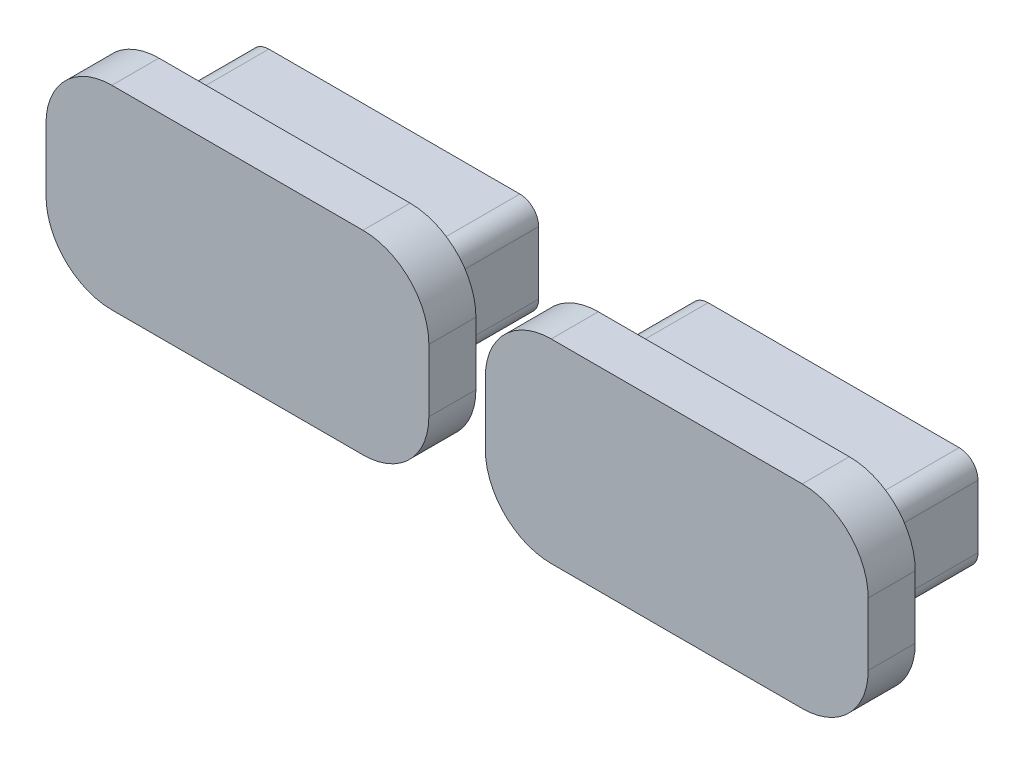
from build123d import *

# Parameters (mm, degrees)
BOSS_EXTRUDE1_DEPTH   = 1.905
BOSS_EXTRUDE1_2_DEPTH = 1.905
BOSS_EXTRUDE2_DEPTH   = 4.445
BOSS_EXTRUDE2_2_DEPTH = 4.445


with BuildPart() as part:
    # Sketch1 → Boss-Extrude1 (new body)
    with BuildSketch(Plane.XY):
        with BuildLine():
            Line((19.162, -55.245), (19.162, -52.705))
            ThreePointArc((19.162, -52.705), (18.380853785, -50.819146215), (16.495, -50.038))
            Line((16.495, -50.038), (6.335, -50.038))
            ThreePointArc((6.335, -50.038), (4.449146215, -50.819146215), (3.668, -52.705))
            Line((3.668, -52.705), (3.668, -55.245))
            ThreePointArc((3.668, -55.245), (4.449146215, -57.130853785), (6.335, -57.912))
            Line((6.335, -57.912), (16.495, -57.912))
            ThreePointArc((16.495, -57.912), (18.380853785, -57.130853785), (19.162, -55.245))
        make_face()
    extrude(amount=-BOSS_EXTRUDE1_DEPTH)


with BuildPart() as body_2:
    # Sketch1 → Boss-Extrude1 2 (new body)
    with BuildSketch(Plane.XY):
        with BuildLine():
            Line((21.448, -52.705), (21.448, -55.245))
            ThreePointArc((21.448, -55.245), (22.229146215, -57.130853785), (24.115, -57.912))
            Line((24.115, -57.912), (34.275, -57.912))
            ThreePointArc((34.275, -57.912), (36.160853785, -57.130853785), (36.942, -55.245))
            Line((36.942, -55.245), (36.942, -52.705))
            ThreePointArc((36.942, -52.705), (36.160853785, -50.819146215), (34.275, -50.038))
            Line((34.275, -50.038), (24.115, -50.038))
            ThreePointArc((24.115, -50.038), (22.229146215, -50.819146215), (21.448, -52.705))
        make_face()
    extrude(amount=-BOSS_EXTRUDE1_2_DEPTH)


with BuildPart() as body_3:
    # Sketch2 → Boss-Extrude2 (new body)
    with BuildSketch(Plane(origin=(0, 0, -1.905), x_dir=(-1, 0, 0), z_dir=(0, 0, -1))):
        with BuildLine():
            Line((-5.573, -55.245), (-5.573, -52.705))
            ThreePointArc((-5.573, -52.705), (-5.796184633, -52.166184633), (-6.335, -51.943))
            Line((-6.335, -51.943), (-16.495, -51.943))
            ThreePointArc((-16.495, -51.943), (-17.033815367, -52.166184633), (-17.257, -52.705))
            Line((-17.257, -52.705), (-17.257, -55.245))
            ThreePointArc((-17.257, -55.245), (-17.033815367, -55.783815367), (-16.495, -56.007))
            Line((-16.495, -56.007), (-6.335, -56.007))
            ThreePointArc((-6.335, -56.007), (-5.796184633, -55.783815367), (-5.573, -55.245))
        make_face()
    extrude(amount=BOSS_EXTRUDE2_DEPTH)


with BuildPart() as body_4:
    # Sketch2 → Boss-Extrude2 2 (new body)
    with BuildSketch(Plane(origin=(0, 0, -1.905), x_dir=(-1, 0, 0), z_dir=(0, 0, -1))):
        with BuildLine():
            Line((-35.037, -52.705), (-35.037, -55.245))
            ThreePointArc((-35.037, -55.245), (-34.813815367, -55.783815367), (-34.275, -56.007))
            Line((-34.275, -56.007), (-24.115, -56.007))
            ThreePointArc((-24.115, -56.007), (-23.576184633, -55.783815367), (-23.353, -55.245))
            Line((-23.353, -55.245), (-23.353, -52.705))
            ThreePointArc((-23.353, -52.705), (-23.576184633, -52.166184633), (-24.115, -51.943))
            Line((-24.115, -51.943), (-34.275, -51.943))
            ThreePointArc((-34.275, -51.943), (-34.813815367, -52.166184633), (-35.037, -52.705))
        make_face()
    extrude(amount=BOSS_EXTRUDE2_2_DEPTH)


solid = Compound([part.part, body_2.part, body_3.part, body_4.part])
